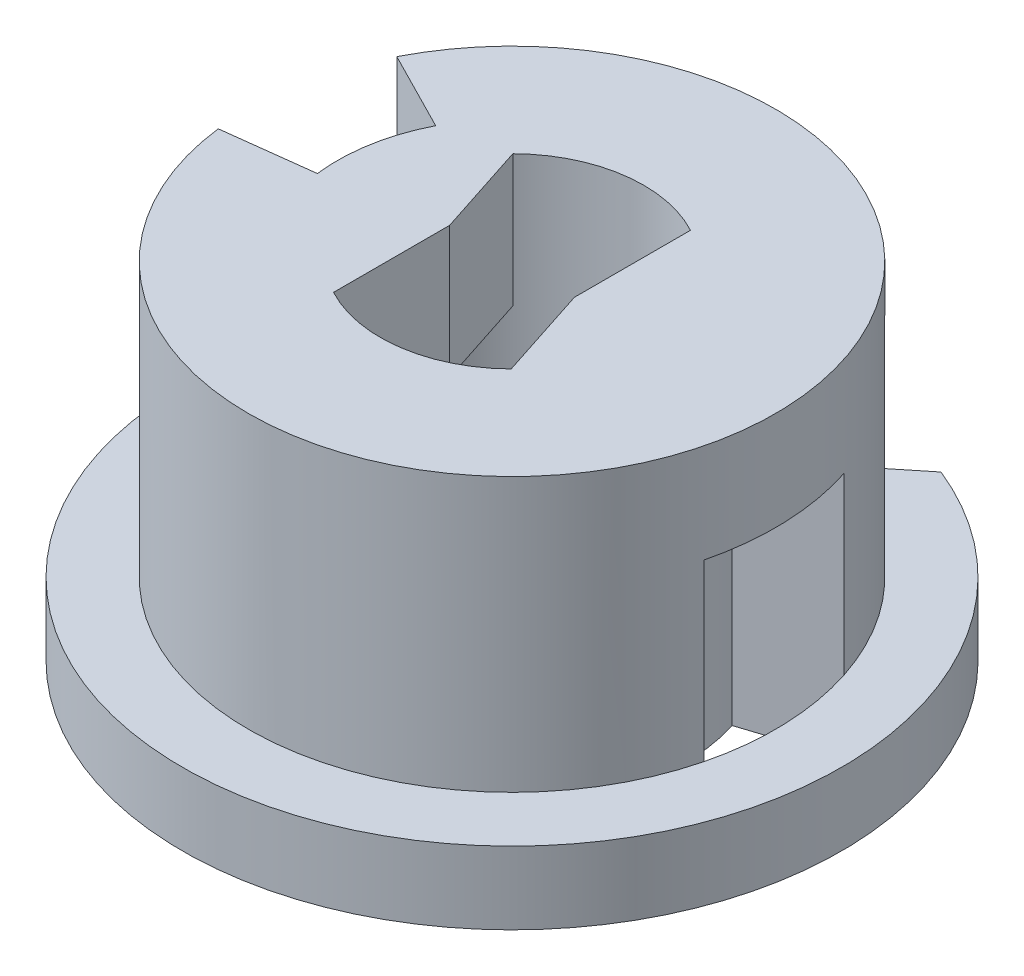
ISO-10303-21;
HEADER;
FILE_DESCRIPTION(('STEP AP214'),'2;1');
FILE_NAME('part.step','',(''),(''),'','','');
FILE_SCHEMA(('AUTOMOTIVE_DESIGN { 1 0 10303 214 1 1 1 1 }'));
ENDSEC;
DATA;
#1=APPLICATION_CONTEXT('core data for automotive mechanical design processes');
#2=APPLICATION_PROTOCOL_DEFINITION('international standard','automotive_design',2000,#1);
#3=PRODUCT_CONTEXT('',#1,'mechanical');
#4=PRODUCT('Part','Part','',(#3));
#5=PRODUCT_RELATED_PRODUCT_CATEGORY('part','',(#4));
#6=PRODUCT_DEFINITION_FORMATION('','',#4);
#7=PRODUCT_DEFINITION_CONTEXT('part definition',#1,'design');
#8=PRODUCT_DEFINITION('design','',#6,#7);
#9=PRODUCT_DEFINITION_SHAPE('','',#8);
#10=(LENGTH_UNIT() NAMED_UNIT(*) SI_UNIT(.MILLI.,.METRE.));
#11=(NAMED_UNIT(*) PLANE_ANGLE_UNIT() SI_UNIT($,.RADIAN.));
#12=(NAMED_UNIT(*) SI_UNIT($,.STERADIAN.) SOLID_ANGLE_UNIT());
#13=UNCERTAINTY_MEASURE_WITH_UNIT(LENGTH_MEASURE(1.E-05),#10,'distance_accuracy_value','');
#14=(GEOMETRIC_REPRESENTATION_CONTEXT(3) GLOBAL_UNCERTAINTY_ASSIGNED_CONTEXT((#13)) GLOBAL_UNIT_ASSIGNED_CONTEXT((#10,
#11,#12)) REPRESENTATION_CONTEXT('',''));
#15=CARTESIAN_POINT('',(0.,0.,0.));
#16=DIRECTION('',(0.,0.,1.));
#17=DIRECTION('',(1.,0.,0.));
#18=AXIS2_PLACEMENT_3D('',#15,#16,#17);
#19=CARTESIAN_POINT('',(0.,6.5,0.));
#20=DIRECTION('',(0.,-1.,0.));
#21=DIRECTION('',(0.,0.,-1.));
#22=AXIS2_PLACEMENT_3D('',#19,#20,#21);
#23=PLANE('',#22);
#24=DIRECTION('',(0.,0.,-1.));
#25=VECTOR('',#24,1.);
#26=CARTESIAN_POINT('',(-1.89263200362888,6.5,0.));
#27=LINE('',#26,#25);
#28=CARTESIAN_POINT('',(-1.89263200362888,6.5,3.52391034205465));
#29=VERTEX_POINT('',#28);
#30=CARTESIAN_POINT('',(-1.89263200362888,6.5,0.));
#31=VERTEX_POINT('',#30);
#32=EDGE_CURVE('E11',#29,#31,#27,.T.);
#33=ORIENTED_EDGE('',*,*,#32,.F.);
#34=CARTESIAN_POINT('',(0.,6.5,0.));
#35=DIRECTION('',(0.,-1.,0.));
#36=DIRECTION('',(0.,0.,-1.));
#37=AXIS2_PLACEMENT_3D('',#34,#35,#36);
#38=CIRCLE('',#37,4.);
#39=CARTESIAN_POINT('',(-2.81574572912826,6.5,-2.84105191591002));
#40=VERTEX_POINT('',#39);
#41=EDGE_CURVE('E611',#29,#40,#38,.T.);
#42=ORIENTED_EDGE('',*,*,#41,.T.);
#43=DIRECTION('',(-0.309016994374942,0.,-0.951056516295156));
#44=VECTOR('',#43,1.);
#45=CARTESIAN_POINT('',(-1.71190172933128,6.5,0.556230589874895));
#46=LINE('',#45,#44);
#47=EDGE_CURVE('E374',#31,#40,#46,.T.);
#48=ORIENTED_EDGE('',*,*,#47,.F.);
#49=EDGE_LOOP('',(#33,#42,#48));
#50=FACE_BOUND('',#49,.T.);
#51=ADVANCED_FACE('F366',(#50),#23,.T.);
#52=CARTESIAN_POINT('',(0.,2.2,0.));
#53=DIRECTION('',(0.,1.,0.));
#54=DIRECTION('',(0.,0.,1.));
#55=AXIS2_PLACEMENT_3D('',#52,#53,#54);
#56=PLANE('',#55);
#57=CARTESIAN_POINT('',(0.,2.2,0.));
#58=DIRECTION('',(0.,1.,0.));
#59=DIRECTION('',(0.,0.,1.));
#60=AXIS2_PLACEMENT_3D('',#57,#58,#59);
#61=CIRCLE('',#60,10.);
#62=CARTESIAN_POINT('',(-7.07106781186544,2.2,-7.07106781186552));
#63=VERTEX_POINT('',#62);
#64=CARTESIAN_POINT('',(3.74606593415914,2.2,-9.27183854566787));
#65=VERTEX_POINT('',#64);
#66=EDGE_CURVE('E658',#63,#65,#61,.T.);
#67=ORIENTED_EDGE('',*,*,#66,.T.);
#68=DIRECTION('',(-0.777145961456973,0.,0.629320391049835));
#69=VECTOR('',#68,1.);
#70=CARTESIAN_POINT('',(-3.05100579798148,2.2,-3.7676783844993));
#71=LINE('',#70,#69);
#72=CARTESIAN_POINT('',(1.89447433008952,2.2,-7.77244922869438));
#73=VERTEX_POINT('',#72);
#74=EDGE_CURVE('E645',#65,#73,#71,.T.);
#75=ORIENTED_EDGE('',*,*,#74,.T.);
#76=CARTESIAN_POINT('',(0.,2.2,0.));
#77=DIRECTION('',(0.,1.,0.));
#78=DIRECTION('',(0.,0.,1.));
#79=AXIS2_PLACEMENT_3D('',#76,#77,#78);
#80=CIRCLE('',#79,8.);
#81=CARTESIAN_POINT('',(7.60845213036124,2.2,-2.47213595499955));
#82=VERTEX_POINT('',#81);
#83=EDGE_CURVE('E648',#82,#73,#80,.T.);
#84=ORIENTED_EDGE('',*,*,#83,.F.);
#85=CARTESIAN_POINT('',(7.76236581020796,2.2,1.93537516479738));
#86=VERTEX_POINT('',#85);
#87=EDGE_CURVE('E516',#86,#82,#80,.T.);
#88=ORIENTED_EDGE('',*,*,#87,.F.);
#89=CARTESIAN_POINT('',(-5.65685424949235,2.2,-5.65685424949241));
#90=VERTEX_POINT('',#89);
#91=EDGE_CURVE('E649',#90,#86,#80,.T.);
#92=ORIENTED_EDGE('',*,*,#91,.F.);
#93=DIRECTION('',(-0.707106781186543,0.,-0.707106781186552));
#94=VECTOR('',#93,1.);
#95=CARTESIAN_POINT('',(0.,2.2,0.));
#96=LINE('',#95,#94);
#97=EDGE_CURVE('E636',#90,#63,#96,.T.);
#98=ORIENTED_EDGE('',*,*,#97,.T.);
#99=EDGE_LOOP('',(#67,#75,#84,#88,#92,#98));
#100=FACE_BOUND('',#99,.T.);
#101=ADVANCED_FACE('F716',(#100),#56,.T.);
#102=CARTESIAN_POINT('',(0.,2.2,0.));
#103=DIRECTION('',(0.,-1.,0.));
#104=DIRECTION('',(0.,0.,-1.));
#105=AXIS2_PLACEMENT_3D('',#102,#103,#104);
#106=CYLINDRICAL_SURFACE('',#105,10.);
#107=DIRECTION('',(0.,-1.,0.));
#108=VECTOR('',#107,1.);
#109=CARTESIAN_POINT('',(3.74606593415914,3.2,-9.27183854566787));
#110=LINE('',#109,#108);
#111=CARTESIAN_POINT('',(3.74606593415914,0.,-9.27183854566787));
#112=VERTEX_POINT('',#111);
#113=EDGE_CURVE('E637',#65,#112,#110,.T.);
#114=ORIENTED_EDGE('',*,*,#113,.F.);
#115=ORIENTED_EDGE('',*,*,#66,.F.);
#116=DIRECTION('',(0.,-1.,0.));
#117=VECTOR('',#116,1.);
#118=CARTESIAN_POINT('',(-7.07106781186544,3.2,-7.07106781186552));
#119=LINE('',#118,#117);
#120=CARTESIAN_POINT('',(-7.07106781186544,0.,-7.07106781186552));
#121=VERTEX_POINT('',#120);
#122=EDGE_CURVE('E639',#63,#121,#119,.T.);
#123=ORIENTED_EDGE('',*,*,#122,.T.);
#124=CARTESIAN_POINT('',(0.,0.,0.));
#125=DIRECTION('',(0.,1.,0.));
#126=DIRECTION('',(0.,0.,1.));
#127=AXIS2_PLACEMENT_3D('',#124,#125,#126);
#128=CIRCLE('',#127,10.);
#129=EDGE_CURVE('E655',#121,#112,#128,.T.);
#130=ORIENTED_EDGE('',*,*,#129,.T.);
#131=EDGE_LOOP('',(#114,#115,#123,#130));
#132=FACE_BOUND('',#131,.T.);
#133=ADVANCED_FACE('F368',(#132),#106,.T.);
#134=CARTESIAN_POINT('',(0.,0.,0.));
#135=DIRECTION('',(0.,1.,0.));
#136=DIRECTION('',(0.,0.,1.));
#137=AXIS2_PLACEMENT_3D('',#134,#135,#136);
#138=PLANE('',#137);
#139=DIRECTION('',(0.951056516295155,0.,-0.309016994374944));
#140=VECTOR('',#139,1.);
#141=CARTESIAN_POINT('',(5.04059953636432,0.,-1.6377900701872));
#142=LINE('',#141,#140);
#143=CARTESIAN_POINT('',(5.04059953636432,0.,-1.6377900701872));
#144=VERTEX_POINT('',#143);
#145=CARTESIAN_POINT('',(7.60845213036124,0.,-2.47213595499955));
#146=VERTEX_POINT('',#145);
#147=EDGE_CURVE('E523',#144,#146,#142,.T.);
#148=ORIENTED_EDGE('',*,*,#147,.F.);
#149=CARTESIAN_POINT('',(0.,0.,0.));
#150=DIRECTION('',(0.,1.,0.));
#151=DIRECTION('',(0.,0.,-1.));
#152=AXIS2_PLACEMENT_3D('',#149,#150,#151);
#153=CIRCLE('',#152,5.3);
#154=CARTESIAN_POINT('',(5.14256734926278,0.,1.28218604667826));
#155=VERTEX_POINT('',#154);
#156=EDGE_CURVE('E381',#155,#144,#153,.T.);
#157=ORIENTED_EDGE('',*,*,#156,.F.);
#158=DIRECTION('',(-0.970295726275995,0.,-0.241921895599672));
#159=VECTOR('',#158,1.);
#160=CARTESIAN_POINT('',(5.14256734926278,0.,1.28218604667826));
#161=LINE('',#160,#159);
#162=CARTESIAN_POINT('',(7.76236581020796,0.,1.93537516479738));
#163=VERTEX_POINT('',#162);
#164=EDGE_CURVE('E530',#163,#155,#161,.T.);
#165=ORIENTED_EDGE('',*,*,#164,.F.);
#166=CARTESIAN_POINT('',(0.,0.,0.));
#167=DIRECTION('',(0.,-1.,0.));
#168=DIRECTION('',(0.,0.,-1.));
#169=AXIS2_PLACEMENT_3D('',#166,#167,#168);
#170=CIRCLE('',#169,8.);
#171=EDGE_CURVE('E513',#146,#163,#170,.T.);
#172=ORIENTED_EDGE('',*,*,#171,.F.);
#173=EDGE_LOOP('',(#148,#157,#165,#172));
#174=FACE_BOUND('',#173,.T.);
#175=CARTESIAN_POINT('',(0.,0.,0.));
#176=DIRECTION('',(0.,-1.,0.));
#177=DIRECTION('',(0.,0.,-1.));
#178=AXIS2_PLACEMENT_3D('',#175,#176,#177);
#179=CIRCLE('',#178,4.);
#180=CARTESIAN_POINT('',(0.,0.,-4.));
#181=VERTEX_POINT('',#180);
#182=EDGE_CURVE('E598',#181,#181,#179,.T.);
#183=ORIENTED_EDGE('',*,*,#182,.F.);
#184=EDGE_LOOP('',(#183));
#185=FACE_BOUND('',#184,.T.);
#186=DIRECTION('',(0.777145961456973,0.,-0.629320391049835));
#187=VECTOR('',#186,1.);
#188=CARTESIAN_POINT('',(7.7777832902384,0.,-12.536658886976));
#189=LINE('',#188,#187);
#190=CARTESIAN_POINT('',(0.3137726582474,0.,-6.49242225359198));
#191=VERTEX_POINT('',#190);
#192=EDGE_CURVE('E621',#191,#112,#189,.T.);
#193=ORIENTED_EDGE('',*,*,#192,.T.);
#194=ORIENTED_EDGE('',*,*,#129,.F.);
#195=DIRECTION('',(0.707106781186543,0.,0.707106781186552));
#196=VECTOR('',#195,1.);
#197=CARTESIAN_POINT('',(-11.0707106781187,0.,-11.0707106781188));
#198=LINE('',#197,#196);
#199=CARTESIAN_POINT('',(-4.59619407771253,0.,-4.59619407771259));
#200=VERTEX_POINT('',#199);
#201=EDGE_CURVE('E618',#121,#200,#198,.T.);
#202=ORIENTED_EDGE('',*,*,#201,.T.);
#203=CARTESIAN_POINT('',(0.,0.,0.));
#204=DIRECTION('',(0.,-1.,0.));
#205=DIRECTION('',(0.,0.,-1.));
#206=AXIS2_PLACEMENT_3D('',#203,#204,#205);
#207=CIRCLE('',#206,6.5);
#208=EDGE_CURVE('E615',#200,#191,#207,.T.);
#209=ORIENTED_EDGE('',*,*,#208,.T.);
#210=EDGE_LOOP('',(#193,#194,#202,#209));
#211=FACE_BOUND('',#210,.T.);
#212=ADVANCED_FACE('F527',(#174,#185,#211),#138,.F.);
#213=CARTESIAN_POINT('',(0.,10.5,0.));
#214=DIRECTION('',(0.,-1.,0.));
#215=DIRECTION('',(0.,0.,-1.));
#216=AXIS2_PLACEMENT_3D('',#213,#214,#215);
#217=CYLINDRICAL_SURFACE('',#216,8.);
#218=ORIENTED_EDGE('',*,*,#91,.T.);
#219=DIRECTION('',(0.,-1.,0.));
#220=VECTOR('',#219,1.);
#221=CARTESIAN_POINT('',(7.76236581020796,7.5,1.93537516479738));
#222=LINE('',#221,#220);
#223=CARTESIAN_POINT('',(7.76236581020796,7.5,1.93537516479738));
#224=VERTEX_POINT('',#223);
#225=EDGE_CURVE('E546',#224,#86,#222,.T.);
#226=ORIENTED_EDGE('',*,*,#225,.F.);
#227=CARTESIAN_POINT('',(0.,7.5,0.));
#228=DIRECTION('',(0.,-1.,0.));
#229=DIRECTION('',(0.,0.,-1.));
#230=AXIS2_PLACEMENT_3D('',#227,#228,#229);
#231=CIRCLE('',#230,8.);
#232=CARTESIAN_POINT('',(7.60845213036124,7.5,-2.47213595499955));
#233=VERTEX_POINT('',#232);
#234=EDGE_CURVE('E538',#233,#224,#231,.T.);
#235=ORIENTED_EDGE('',*,*,#234,.F.);
#236=DIRECTION('',(0.,-1.,0.));
#237=VECTOR('',#236,1.);
#238=CARTESIAN_POINT('',(7.60845213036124,7.5,-2.47213595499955));
#239=LINE('',#238,#237);
#240=EDGE_CURVE('E519',#233,#82,#239,.T.);
#241=ORIENTED_EDGE('',*,*,#240,.T.);
#242=ORIENTED_EDGE('',*,*,#83,.T.);
#243=DIRECTION('',(0.,-1.,0.));
#244=VECTOR('',#243,1.);
#245=CARTESIAN_POINT('',(1.89447433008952,10.5,-7.77244922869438));
#246=LINE('',#245,#244);
#247=CARTESIAN_POINT('',(1.89447433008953,3.2,-7.77244922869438));
#248=VERTEX_POINT('',#247);
#249=EDGE_CURVE('E666',#248,#73,#246,.T.);
#250=ORIENTED_EDGE('',*,*,#249,.F.);
#251=CARTESIAN_POINT('',(0.,3.2,0.));
#252=DIRECTION('',(0.,-1.,0.));
#253=DIRECTION('',(0.,0.,-1.));
#254=AXIS2_PLACEMENT_3D('',#251,#252,#253);
#255=CIRCLE('',#254,8.);
#256=CARTESIAN_POINT('',(-5.65685424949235,3.2,-5.65685424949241));
#257=VERTEX_POINT('',#256);
#258=EDGE_CURVE('E661',#257,#248,#255,.T.);
#259=ORIENTED_EDGE('',*,*,#258,.F.);
#260=DIRECTION('',(0.,-1.,0.));
#261=VECTOR('',#260,1.);
#262=CARTESIAN_POINT('',(-5.65685424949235,10.5,-5.65685424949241));
#263=LINE('',#262,#261);
#264=EDGE_CURVE('E663',#90,#257,#263,.F.);
#265=ORIENTED_EDGE('',*,*,#264,.F.);
#266=EDGE_LOOP('',(#218,#226,#235,#241,#242,#250,#259,#265));
#267=FACE_BOUND('',#266,.T.);
#268=CARTESIAN_POINT('',(0.,10.5,0.));
#269=DIRECTION('',(0.,1.,0.));
#270=DIRECTION('',(0.,0.,1.));
#271=AXIS2_PLACEMENT_3D('',#268,#269,#270);
#272=CIRCLE('',#271,8.);
#273=CARTESIAN_POINT('',(-7.94036921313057,10.5,0.974954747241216));
#274=VERTEX_POINT('',#273);
#275=CARTESIAN_POINT('',(-7.12805219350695,10.5,-3.63192399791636));
#276=VERTEX_POINT('',#275);
#277=EDGE_CURVE('E652',#274,#276,#272,.T.);
#278=ORIENTED_EDGE('',*,*,#277,.F.);
#279=DIRECTION('',(0.,1.,0.));
#280=VECTOR('',#279,1.);
#281=CARTESIAN_POINT('',(-7.94036921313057,5.5,0.974954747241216));
#282=LINE('',#281,#280);
#283=CARTESIAN_POINT('',(-7.94036921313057,5.5,0.974954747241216));
#284=VERTEX_POINT('',#283);
#285=EDGE_CURVE('E572',#284,#274,#282,.T.);
#286=ORIENTED_EDGE('',*,*,#285,.F.);
#287=CARTESIAN_POINT('',(0.,5.5,0.));
#288=DIRECTION('',(0.,1.,0.));
#289=DIRECTION('',(0.,0.,1.));
#290=AXIS2_PLACEMENT_3D('',#287,#288,#289);
#291=CIRCLE('',#290,8.);
#292=CARTESIAN_POINT('',(-7.12805219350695,5.5,-3.63192399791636));
#293=VERTEX_POINT('',#292);
#294=EDGE_CURVE('E563',#293,#284,#291,.T.);
#295=ORIENTED_EDGE('',*,*,#294,.F.);
#296=DIRECTION('',(0.,1.,0.));
#297=VECTOR('',#296,1.);
#298=CARTESIAN_POINT('',(-7.12805219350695,5.5,-3.63192399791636));
#299=LINE('',#298,#297);
#300=EDGE_CURVE('E574',#293,#276,#299,.T.);
#301=ORIENTED_EDGE('',*,*,#300,.T.);
#302=EDGE_LOOP('',(#278,#286,#295,#301));
#303=FACE_BOUND('',#302,.T.);
#304=ADVANCED_FACE('F730',(#267,#303),#217,.T.);
#305=CARTESIAN_POINT('',(0.,10.5,0.));
#306=DIRECTION('',(0.,1.,0.));
#307=DIRECTION('',(0.,0.,1.));
#308=AXIS2_PLACEMENT_3D('',#305,#306,#307);
#309=PLANE('',#308);
#310=DIRECTION('',(0.992546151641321,0.,-0.121869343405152));
#311=VECTOR('',#310,1.);
#312=CARTESIAN_POINT('',(-5.260494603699,10.5,0.645907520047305));
#313=LINE('',#312,#311);
#314=CARTESIAN_POINT('',(-5.260494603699,10.5,0.645907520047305));
#315=VERTEX_POINT('',#314);
#316=EDGE_CURVE('E554',#274,#315,#313,.T.);
#317=ORIENTED_EDGE('',*,*,#316,.F.);
#318=ORIENTED_EDGE('',*,*,#277,.T.);
#319=DIRECTION('',(-0.891006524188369,0.,-0.453990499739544));
#320=VECTOR('',#319,1.);
#321=CARTESIAN_POINT('',(-4.72233457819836,10.5,-2.40614964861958));
#322=LINE('',#321,#320);
#323=CARTESIAN_POINT('',(-4.72233457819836,10.5,-2.40614964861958));
#324=VERTEX_POINT('',#323);
#325=EDGE_CURVE('E552',#324,#276,#322,.T.);
#326=ORIENTED_EDGE('',*,*,#325,.F.);
#327=CARTESIAN_POINT('',(0.,10.5,0.));
#328=DIRECTION('',(0.,-1.,0.));
#329=DIRECTION('',(0.,0.,1.));
#330=AXIS2_PLACEMENT_3D('',#327,#328,#329);
#331=CIRCLE('',#330,5.3);
#332=EDGE_CURVE('E545',#315,#324,#331,.T.);
#333=ORIENTED_EDGE('',*,*,#332,.F.);
#334=EDGE_LOOP('',(#317,#318,#326,#333));
#335=FACE_BOUND('',#334,.T.);
#336=CARTESIAN_POINT('',(0.,10.5,0.));
#337=DIRECTION('',(0.,1.,0.));
#338=DIRECTION('',(0.,0.,1.));
#339=AXIS2_PLACEMENT_3D('',#336,#337,#338);
#340=CIRCLE('',#339,4.);
#341=CARTESIAN_POINT('',(-1.89263200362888,10.5,3.52391034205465));
#342=VERTEX_POINT('',#341);
#343=CARTESIAN_POINT('',(2.81574572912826,10.5,2.84105191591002));
#344=VERTEX_POINT('',#343);
#345=EDGE_CURVE('E571',#342,#344,#340,.T.);
#346=ORIENTED_EDGE('',*,*,#345,.F.);
#347=DIRECTION('',(0.,0.,1.));
#348=VECTOR('',#347,1.);
#349=CARTESIAN_POINT('',(-1.89263200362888,10.5,0.));
#350=LINE('',#349,#348);
#351=CARTESIAN_POINT('',(-1.89263200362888,10.5,0.));
#352=VERTEX_POINT('',#351);
#353=EDGE_CURVE('E592',#352,#342,#350,.T.);
#354=ORIENTED_EDGE('',*,*,#353,.F.);
#355=DIRECTION('',(0.309016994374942,0.,0.951056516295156));
#356=VECTOR('',#355,1.);
#357=CARTESIAN_POINT('',(-2.81574572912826,10.5,-2.84105191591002));
#358=LINE('',#357,#356);
#359=CARTESIAN_POINT('',(-2.81574572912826,10.5,-2.84105191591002));
#360=VERTEX_POINT('',#359);
#361=EDGE_CURVE('E589',#360,#352,#358,.T.);
#362=ORIENTED_EDGE('',*,*,#361,.F.);
#363=CARTESIAN_POINT('',(0.,10.5,0.));
#364=DIRECTION('',(0.,1.,0.));
#365=DIRECTION('',(0.,0.,1.));
#366=AXIS2_PLACEMENT_3D('',#363,#364,#365);
#367=CIRCLE('',#366,4.);
#368=CARTESIAN_POINT('',(1.89263200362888,10.5,-3.52391034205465));
#369=VERTEX_POINT('',#368);
#370=EDGE_CURVE('E586',#369,#360,#367,.T.);
#371=ORIENTED_EDGE('',*,*,#370,.F.);
#372=DIRECTION('',(0.,0.,-1.));
#373=VECTOR('',#372,1.);
#374=CARTESIAN_POINT('',(1.89263200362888,10.5,0.));
#375=LINE('',#374,#373);
#376=CARTESIAN_POINT('',(1.89263200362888,10.5,0.));
#377=VERTEX_POINT('',#376);
#378=EDGE_CURVE('E583',#377,#369,#375,.T.);
#379=ORIENTED_EDGE('',*,*,#378,.F.);
#380=DIRECTION('',(-0.309016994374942,0.,-0.951056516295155));
#381=VECTOR('',#380,1.);
#382=CARTESIAN_POINT('',(2.81574572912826,10.5,2.84105191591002));
#383=LINE('',#382,#381);
#384=EDGE_CURVE('E580',#344,#377,#383,.T.);
#385=ORIENTED_EDGE('',*,*,#384,.F.);
#386=EDGE_LOOP('',(#346,#354,#362,#371,#379,#385));
#387=FACE_BOUND('',#386,.T.);
#388=ADVANCED_FACE('F698',(#335,#387),#309,.T.);
#389=CARTESIAN_POINT('',(0.,3.2,-22.1414213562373));
#390=DIRECTION('',(0.,-1.,0.));
#391=DIRECTION('',(0.,0.,-1.));
#392=AXIS2_PLACEMENT_3D('',#389,#390,#391);
#393=PLANE('',#392);
#394=ORIENTED_EDGE('',*,*,#258,.T.);
#395=DIRECTION('',(0.777145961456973,0.,-0.629320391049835));
#396=VECTOR('',#395,1.);
#397=CARTESIAN_POINT('',(7.7777832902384,3.2,-12.536658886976));
#398=LINE('',#397,#396);
#399=CARTESIAN_POINT('',(0.3137726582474,3.2,-6.49242225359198));
#400=VERTEX_POINT('',#399);
#401=EDGE_CURVE('E629',#400,#248,#398,.T.);
#402=ORIENTED_EDGE('',*,*,#401,.F.);
#403=CARTESIAN_POINT('',(0.,3.2,0.));
#404=DIRECTION('',(0.,-1.,0.));
#405=DIRECTION('',(0.,0.,-1.));
#406=AXIS2_PLACEMENT_3D('',#403,#404,#405);
#407=CIRCLE('',#406,6.5);
#408=CARTESIAN_POINT('',(-4.59619407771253,3.2,-4.59619407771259));
#409=VERTEX_POINT('',#408);
#410=EDGE_CURVE('E624',#409,#400,#407,.T.);
#411=ORIENTED_EDGE('',*,*,#410,.F.);
#412=DIRECTION('',(0.707106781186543,0.,0.707106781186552));
#413=VECTOR('',#412,1.);
#414=CARTESIAN_POINT('',(-11.0707106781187,3.2,-11.0707106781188));
#415=LINE('',#414,#413);
#416=EDGE_CURVE('E627',#257,#409,#415,.T.);
#417=ORIENTED_EDGE('',*,*,#416,.F.);
#418=EDGE_LOOP('',(#394,#402,#411,#417));
#419=FACE_BOUND('',#418,.T.);
#420=ADVANCED_FACE('F736',(#419),#393,.T.);
#421=CARTESIAN_POINT('',(0.,3.2,0.));
#422=DIRECTION('',(0.,-1.,0.));
#423=DIRECTION('',(0.,0.,-1.));
#424=AXIS2_PLACEMENT_3D('',#421,#422,#423);
#425=CYLINDRICAL_SURFACE('',#424,6.5);
#426=ORIENTED_EDGE('',*,*,#208,.F.);
#427=DIRECTION('',(0.,-1.,0.));
#428=VECTOR('',#427,1.);
#429=CARTESIAN_POINT('',(-4.59619407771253,3.2,-4.59619407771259));
#430=LINE('',#429,#428);
#431=EDGE_CURVE('E632',#409,#200,#430,.T.);
#432=ORIENTED_EDGE('',*,*,#431,.F.);
#433=ORIENTED_EDGE('',*,*,#410,.T.);
#434=DIRECTION('',(0.,-1.,0.));
#435=VECTOR('',#434,1.);
#436=CARTESIAN_POINT('',(0.3137726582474,3.2,-6.49242225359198));
#437=LINE('',#436,#435);
#438=EDGE_CURVE('E633',#400,#191,#437,.T.);
#439=ORIENTED_EDGE('',*,*,#438,.T.);
#440=EDGE_LOOP('',(#426,#432,#433,#439));
#441=FACE_BOUND('',#440,.T.);
#442=ADVANCED_FACE('F738',(#441),#425,.T.);
#443=CARTESIAN_POINT('',(7.7777832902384,3.2,-12.536658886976));
#444=DIRECTION('',(-0.629320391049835,0.,-0.777145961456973));
#445=DIRECTION('',(-0.777145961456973,0.,0.629320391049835));
#446=AXIS2_PLACEMENT_3D('',#443,#444,#445);
#447=PLANE('',#446);
#448=ORIENTED_EDGE('',*,*,#113,.T.);
#449=ORIENTED_EDGE('',*,*,#192,.F.);
#450=ORIENTED_EDGE('',*,*,#438,.F.);
#451=ORIENTED_EDGE('',*,*,#401,.T.);
#452=ORIENTED_EDGE('',*,*,#249,.T.);
#453=ORIENTED_EDGE('',*,*,#74,.F.);
#454=EDGE_LOOP('',(#448,#449,#450,#451,#452,#453));
#455=FACE_BOUND('',#454,.T.);
#456=ADVANCED_FACE('F741',(#455),#447,.T.);
#457=CARTESIAN_POINT('',(-11.0707106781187,3.2,-11.0707106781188));
#458=DIRECTION('',(0.707106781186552,0.,-0.707106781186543));
#459=DIRECTION('',(-0.707106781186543,0.,-0.707106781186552));
#460=AXIS2_PLACEMENT_3D('',#457,#458,#459);
#461=PLANE('',#460);
#462=ORIENTED_EDGE('',*,*,#264,.T.);
#463=ORIENTED_EDGE('',*,*,#416,.T.);
#464=ORIENTED_EDGE('',*,*,#431,.T.);
#465=ORIENTED_EDGE('',*,*,#201,.F.);
#466=ORIENTED_EDGE('',*,*,#122,.F.);
#467=ORIENTED_EDGE('',*,*,#97,.F.);
#468=EDGE_LOOP('',(#462,#463,#464,#465,#466,#467));
#469=FACE_BOUND('',#468,.T.);
#470=ADVANCED_FACE('F711',(#469),#461,.T.);
#471=CARTESIAN_POINT('',(0.,6.5,0.));
#472=DIRECTION('',(0.,-1.,0.));
#473=DIRECTION('',(0.,0.,-1.));
#474=AXIS2_PLACEMENT_3D('',#471,#472,#473);
#475=CYLINDRICAL_SURFACE('',#474,4.);
#476=ORIENTED_EDGE('',*,*,#182,.T.);
#477=EDGE_LOOP('',(#476));
#478=FACE_BOUND('',#477,.T.);
#479=CARTESIAN_POINT('',(1.89263200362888,6.5,-3.52391034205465));
#480=VERTEX_POINT('',#479);
#481=CARTESIAN_POINT('',(2.81574572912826,6.5,2.84105191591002));
#482=VERTEX_POINT('',#481);
#483=EDGE_CURVE('E612',#480,#482,#38,.T.);
#484=ORIENTED_EDGE('',*,*,#483,.F.);
#485=DIRECTION('',(0.,1.,0.));
#486=VECTOR('',#485,1.);
#487=CARTESIAN_POINT('',(1.89263200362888,0.,-3.52391034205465));
#488=LINE('',#487,#486);
#489=EDGE_CURVE('E603',#480,#369,#488,.T.);
#490=ORIENTED_EDGE('',*,*,#489,.T.);
#491=ORIENTED_EDGE('',*,*,#370,.T.);
#492=DIRECTION('',(0.,1.,0.));
#493=VECTOR('',#492,1.);
#494=CARTESIAN_POINT('',(-2.81574572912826,0.,-2.84105191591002));
#495=LINE('',#494,#493);
#496=EDGE_CURVE('E601',#40,#360,#495,.T.);
#497=ORIENTED_EDGE('',*,*,#496,.F.);
#498=ORIENTED_EDGE('',*,*,#41,.F.);
#499=DIRECTION('',(0.,1.,0.));
#500=VECTOR('',#499,1.);
#501=CARTESIAN_POINT('',(-1.89263200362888,0.,3.52391034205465));
#502=LINE('',#501,#500);
#503=EDGE_CURVE('E596',#29,#342,#502,.T.);
#504=ORIENTED_EDGE('',*,*,#503,.T.);
#505=ORIENTED_EDGE('',*,*,#345,.T.);
#506=DIRECTION('',(0.,1.,0.));
#507=VECTOR('',#506,1.);
#508=CARTESIAN_POINT('',(2.81574572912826,0.,2.84105191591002));
#509=LINE('',#508,#507);
#510=EDGE_CURVE('E595',#482,#344,#509,.T.);
#511=ORIENTED_EDGE('',*,*,#510,.F.);
#512=EDGE_LOOP('',(#484,#490,#491,#497,#498,#504,#505,#511));
#513=FACE_BOUND('',#512,.T.);
#514=ADVANCED_FACE('F684',(#478,#513),#475,.F.);
#515=DIRECTION('',(0.,0.,1.));
#516=VECTOR('',#515,1.);
#517=CARTESIAN_POINT('',(1.89263200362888,6.5,0.));
#518=LINE('',#517,#516);
#519=CARTESIAN_POINT('',(1.89263200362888,6.5,0.));
#520=VERTEX_POINT('',#519);
#521=EDGE_CURVE('E671',#480,#520,#518,.T.);
#522=ORIENTED_EDGE('',*,*,#521,.F.);
#523=ORIENTED_EDGE('',*,*,#483,.T.);
#524=DIRECTION('',(0.309016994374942,0.,0.951056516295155));
#525=VECTOR('',#524,1.);
#526=CARTESIAN_POINT('',(1.71190172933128,6.5,-0.556230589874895));
#527=LINE('',#526,#525);
#528=EDGE_CURVE('E669',#520,#482,#527,.T.);
#529=ORIENTED_EDGE('',*,*,#528,.F.);
#530=EDGE_LOOP('',(#522,#523,#529));
#531=FACE_BOUND('',#530,.T.);
#532=ADVANCED_FACE('F703',(#531),#23,.T.);
#533=CARTESIAN_POINT('',(-1.89263200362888,0.,0.));
#534=DIRECTION('',(-1.,0.,0.));
#535=DIRECTION('',(0.,0.,1.));
#536=AXIS2_PLACEMENT_3D('',#533,#534,#535);
#537=PLANE('',#536);
#538=ORIENTED_EDGE('',*,*,#32,.T.);
#539=DIRECTION('',(0.,1.,0.));
#540=VECTOR('',#539,1.);
#541=CARTESIAN_POINT('',(-1.89263200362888,0.,0.));
#542=LINE('',#541,#540);
#543=EDGE_CURVE('E599',#31,#352,#542,.T.);
#544=ORIENTED_EDGE('',*,*,#543,.T.);
#545=ORIENTED_EDGE('',*,*,#353,.T.);
#546=ORIENTED_EDGE('',*,*,#503,.F.);
#547=EDGE_LOOP('',(#538,#544,#545,#546));
#548=FACE_BOUND('',#547,.T.);
#549=ADVANCED_FACE('F688',(#548),#537,.F.);
#550=CARTESIAN_POINT('',(-2.81574572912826,0.,-2.84105191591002));
#551=DIRECTION('',(-0.951056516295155,0.,0.309016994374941));
#552=DIRECTION('',(0.309016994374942,0.,0.951056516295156));
#553=AXIS2_PLACEMENT_3D('',#550,#551,#552);
#554=PLANE('',#553);
#555=ORIENTED_EDGE('',*,*,#47,.T.);
#556=ORIENTED_EDGE('',*,*,#496,.T.);
#557=ORIENTED_EDGE('',*,*,#361,.T.);
#558=ORIENTED_EDGE('',*,*,#543,.F.);
#559=EDGE_LOOP('',(#555,#556,#557,#558));
#560=FACE_BOUND('',#559,.T.);
#561=ADVANCED_FACE('F677',(#560),#554,.F.);
#562=CARTESIAN_POINT('',(1.89263200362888,0.,0.));
#563=DIRECTION('',(1.,0.,0.));
#564=DIRECTION('',(0.,0.,-1.));
#565=AXIS2_PLACEMENT_3D('',#562,#563,#564);
#566=PLANE('',#565);
#567=ORIENTED_EDGE('',*,*,#521,.T.);
#568=DIRECTION('',(0.,1.,0.));
#569=VECTOR('',#568,1.);
#570=CARTESIAN_POINT('',(1.89263200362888,0.,0.));
#571=LINE('',#570,#569);
#572=EDGE_CURVE('E605',#520,#377,#571,.T.);
#573=ORIENTED_EDGE('',*,*,#572,.T.);
#574=ORIENTED_EDGE('',*,*,#378,.T.);
#575=ORIENTED_EDGE('',*,*,#489,.F.);
#576=EDGE_LOOP('',(#567,#573,#574,#575));
#577=FACE_BOUND('',#576,.T.);
#578=ADVANCED_FACE('F700',(#577),#566,.F.);
#579=CARTESIAN_POINT('',(2.81574572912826,0.,2.84105191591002));
#580=DIRECTION('',(0.951056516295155,0.,-0.309016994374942));
#581=DIRECTION('',(-0.309016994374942,0.,-0.951056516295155));
#582=AXIS2_PLACEMENT_3D('',#579,#580,#581);
#583=PLANE('',#582);
#584=ORIENTED_EDGE('',*,*,#528,.T.);
#585=ORIENTED_EDGE('',*,*,#510,.T.);
#586=ORIENTED_EDGE('',*,*,#384,.T.);
#587=ORIENTED_EDGE('',*,*,#572,.F.);
#588=EDGE_LOOP('',(#584,#585,#586,#587));
#589=FACE_BOUND('',#588,.T.);
#590=ADVANCED_FACE('F695',(#589),#583,.F.);
#591=CARTESIAN_POINT('',(0.,5.5,0.));
#592=DIRECTION('',(0.,1.,0.));
#593=DIRECTION('',(0.,0.,1.));
#594=AXIS2_PLACEMENT_3D('',#591,#592,#593);
#595=CYLINDRICAL_SURFACE('',#594,5.3);
#596=ORIENTED_EDGE('',*,*,#332,.T.);
#597=DIRECTION('',(0.,1.,0.));
#598=VECTOR('',#597,1.);
#599=CARTESIAN_POINT('',(-4.72233457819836,5.5,-2.40614964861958));
#600=LINE('',#599,#598);
#601=CARTESIAN_POINT('',(-4.72233457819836,5.5,-2.40614964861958));
#602=VERTEX_POINT('',#601);
#603=EDGE_CURVE('E568',#602,#324,#600,.T.);
#604=ORIENTED_EDGE('',*,*,#603,.F.);
#605=CARTESIAN_POINT('',(0.,5.5,0.));
#606=DIRECTION('',(0.,-1.,0.));
#607=DIRECTION('',(0.,0.,1.));
#608=AXIS2_PLACEMENT_3D('',#605,#606,#607);
#609=CIRCLE('',#608,5.3);
#610=CARTESIAN_POINT('',(-5.260494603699,5.5,0.645907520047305));
#611=VERTEX_POINT('',#610);
#612=EDGE_CURVE('E557',#611,#602,#609,.T.);
#613=ORIENTED_EDGE('',*,*,#612,.F.);
#614=DIRECTION('',(0.,1.,0.));
#615=VECTOR('',#614,1.);
#616=CARTESIAN_POINT('',(-5.260494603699,5.5,0.645907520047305));
#617=LINE('',#616,#615);
#618=EDGE_CURVE('E569',#611,#315,#617,.T.);
#619=ORIENTED_EDGE('',*,*,#618,.T.);
#620=EDGE_LOOP('',(#596,#604,#613,#619));
#621=FACE_BOUND('',#620,.T.);
#622=ADVANCED_FACE('F790',(#621),#595,.T.);
#623=CARTESIAN_POINT('',(-5.260494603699,5.5,0.645907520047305));
#624=DIRECTION('',(0.121869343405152,0.,0.992546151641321));
#625=DIRECTION('',(0.992546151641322,0.,-0.121869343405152));
#626=AXIS2_PLACEMENT_3D('',#623,#624,#625);
#627=PLANE('',#626);
#628=ORIENTED_EDGE('',*,*,#316,.T.);
#629=ORIENTED_EDGE('',*,*,#618,.F.);
#630=DIRECTION('',(0.992546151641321,0.,-0.121869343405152));
#631=VECTOR('',#630,1.);
#632=CARTESIAN_POINT('',(-5.260494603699,5.5,0.645907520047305));
#633=LINE('',#632,#631);
#634=EDGE_CURVE('E565',#284,#611,#633,.T.);
#635=ORIENTED_EDGE('',*,*,#634,.F.);
#636=ORIENTED_EDGE('',*,*,#285,.T.);
#637=EDGE_LOOP('',(#628,#629,#635,#636));
#638=FACE_BOUND('',#637,.T.);
#639=ADVANCED_FACE('F787',(#638),#627,.F.);
#640=CARTESIAN_POINT('',(-4.72233457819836,5.5,-2.40614964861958));
#641=DIRECTION('',(0.453990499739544,0.,-0.891006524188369));
#642=DIRECTION('',(-0.891006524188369,0.,-0.453990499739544));
#643=AXIS2_PLACEMENT_3D('',#640,#641,#642);
#644=PLANE('',#643);
#645=ORIENTED_EDGE('',*,*,#325,.T.);
#646=ORIENTED_EDGE('',*,*,#300,.F.);
#647=DIRECTION('',(-0.891006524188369,0.,-0.453990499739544));
#648=VECTOR('',#647,1.);
#649=CARTESIAN_POINT('',(-4.72233457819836,5.5,-2.40614964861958));
#650=LINE('',#649,#648);
#651=EDGE_CURVE('E560',#602,#293,#650,.T.);
#652=ORIENTED_EDGE('',*,*,#651,.F.);
#653=ORIENTED_EDGE('',*,*,#603,.T.);
#654=EDGE_LOOP('',(#645,#646,#652,#653));
#655=FACE_BOUND('',#654,.T.);
#656=ADVANCED_FACE('F781',(#655),#644,.F.);
#657=CARTESIAN_POINT('',(0.,5.5,0.));
#658=DIRECTION('',(0.,1.,0.));
#659=DIRECTION('',(0.,0.,1.));
#660=AXIS2_PLACEMENT_3D('',#657,#658,#659);
#661=PLANE('',#660);
#662=ORIENTED_EDGE('',*,*,#612,.T.);
#663=ORIENTED_EDGE('',*,*,#651,.T.);
#664=ORIENTED_EDGE('',*,*,#294,.T.);
#665=ORIENTED_EDGE('',*,*,#634,.T.);
#666=EDGE_LOOP('',(#662,#663,#664,#665));
#667=FACE_BOUND('',#666,.T.);
#668=ADVANCED_FACE('F775',(#667),#661,.T.);
#669=CARTESIAN_POINT('',(0.,7.5,0.));
#670=DIRECTION('',(0.,-1.,0.));
#671=DIRECTION('',(0.,0.,-1.));
#672=AXIS2_PLACEMENT_3D('',#669,#670,#671);
#673=CYLINDRICAL_SURFACE('',#672,5.3);
#674=ORIENTED_EDGE('',*,*,#156,.T.);
#675=DIRECTION('',(0.,-1.,0.));
#676=VECTOR('',#675,1.);
#677=CARTESIAN_POINT('',(5.04059953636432,7.5,-1.6377900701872));
#678=LINE('',#677,#676);
#679=CARTESIAN_POINT('',(5.04059953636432,7.5,-1.6377900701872));
#680=VERTEX_POINT('',#679);
#681=EDGE_CURVE('E520',#680,#144,#678,.T.);
#682=ORIENTED_EDGE('',*,*,#681,.F.);
#683=CARTESIAN_POINT('',(0.,7.5,0.));
#684=DIRECTION('',(0.,1.,0.));
#685=DIRECTION('',(0.,0.,-1.));
#686=AXIS2_PLACEMENT_3D('',#683,#684,#685);
#687=CIRCLE('',#686,5.3);
#688=CARTESIAN_POINT('',(5.14256734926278,7.5,1.28218604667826));
#689=VERTEX_POINT('',#688);
#690=EDGE_CURVE('E532',#689,#680,#687,.T.);
#691=ORIENTED_EDGE('',*,*,#690,.F.);
#692=DIRECTION('',(0.,-1.,0.));
#693=VECTOR('',#692,1.);
#694=CARTESIAN_POINT('',(5.14256734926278,7.5,1.28218604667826));
#695=LINE('',#694,#693);
#696=EDGE_CURVE('E543',#689,#155,#695,.T.);
#697=ORIENTED_EDGE('',*,*,#696,.T.);
#698=EDGE_LOOP('',(#674,#682,#691,#697));
#699=FACE_BOUND('',#698,.T.);
#700=ADVANCED_FACE('F773',(#699),#673,.T.);
#701=CARTESIAN_POINT('',(5.14256734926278,7.5,1.28218604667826));
#702=DIRECTION('',(-0.241921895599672,0.,0.970295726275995));
#703=DIRECTION('',(0.970295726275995,0.,0.241921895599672));
#704=AXIS2_PLACEMENT_3D('',#701,#702,#703);
#705=PLANE('',#704);
#706=ORIENTED_EDGE('',*,*,#164,.T.);
#707=ORIENTED_EDGE('',*,*,#696,.F.);
#708=DIRECTION('',(-0.970295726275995,0.,-0.241921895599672));
#709=VECTOR('',#708,1.);
#710=CARTESIAN_POINT('',(5.14256734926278,7.5,1.28218604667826));
#711=LINE('',#710,#709);
#712=EDGE_CURVE('E540',#224,#689,#711,.T.);
#713=ORIENTED_EDGE('',*,*,#712,.F.);
#714=ORIENTED_EDGE('',*,*,#225,.T.);
#715=EDGE_CURVE('E548',#86,#163,#222,.T.);
#716=ORIENTED_EDGE('',*,*,#715,.T.);
#717=EDGE_LOOP('',(#706,#707,#713,#714,#716));
#718=FACE_BOUND('',#717,.T.);
#719=ADVANCED_FACE('F770',(#718),#705,.F.);
#720=CARTESIAN_POINT('',(0.,7.5,0.));
#721=DIRECTION('',(0.,-1.,0.));
#722=DIRECTION('',(0.,0.,-1.));
#723=AXIS2_PLACEMENT_3D('',#720,#721,#722);
#724=CYLINDRICAL_SURFACE('',#723,8.);
#725=ORIENTED_EDGE('',*,*,#87,.T.);
#726=EDGE_CURVE('E509',#82,#146,#239,.T.);
#727=ORIENTED_EDGE('',*,*,#726,.T.);
#728=ORIENTED_EDGE('',*,*,#171,.T.);
#729=ORIENTED_EDGE('',*,*,#715,.F.);
#730=EDGE_LOOP('',(#725,#727,#728,#729));
#731=FACE_BOUND('',#730,.T.);
#732=ADVANCED_FACE('F511',(#731),#724,.F.);
#733=CARTESIAN_POINT('',(5.04059953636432,7.5,-1.6377900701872));
#734=DIRECTION('',(-0.309016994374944,0.,-0.951056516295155));
#735=DIRECTION('',(-0.951056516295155,0.,0.309016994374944));
#736=AXIS2_PLACEMENT_3D('',#733,#734,#735);
#737=PLANE('',#736);
#738=ORIENTED_EDGE('',*,*,#147,.T.);
#739=ORIENTED_EDGE('',*,*,#726,.F.);
#740=ORIENTED_EDGE('',*,*,#240,.F.);
#741=DIRECTION('',(0.951056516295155,0.,-0.309016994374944));
#742=VECTOR('',#741,1.);
#743=CARTESIAN_POINT('',(5.04059953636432,7.5,-1.6377900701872));
#744=LINE('',#743,#742);
#745=EDGE_CURVE('E389',#680,#233,#744,.T.);
#746=ORIENTED_EDGE('',*,*,#745,.F.);
#747=ORIENTED_EDGE('',*,*,#681,.T.);
#748=EDGE_LOOP('',(#738,#739,#740,#746,#747));
#749=FACE_BOUND('',#748,.T.);
#750=ADVANCED_FACE('F524',(#749),#737,.F.);
#751=CARTESIAN_POINT('',(0.,7.5,0.));
#752=DIRECTION('',(0.,-1.,0.));
#753=DIRECTION('',(0.,0.,-1.));
#754=AXIS2_PLACEMENT_3D('',#751,#752,#753);
#755=PLANE('',#754);
#756=ORIENTED_EDGE('',*,*,#690,.T.);
#757=ORIENTED_EDGE('',*,*,#745,.T.);
#758=ORIENTED_EDGE('',*,*,#234,.T.);
#759=ORIENTED_EDGE('',*,*,#712,.T.);
#760=EDGE_LOOP('',(#756,#757,#758,#759));
#761=FACE_BOUND('',#760,.T.);
#762=ADVANCED_FACE('F772',(#761),#755,.T.);
#763=CLOSED_SHELL('',(#51,#101,#133,#212,#304,#388,#420,#442,#456,#470,#514,#532,#549,#561,#578,
#590,#622,#639,#656,#668,#700,#719,#732,#750,#762));
#764=MANIFOLD_SOLID_BREP('B2',#763);
#765=ADVANCED_BREP_SHAPE_REPRESENTATION('',(#18,#764),#14);
#766=SHAPE_DEFINITION_REPRESENTATION(#9,#765);
ENDSEC;
END-ISO-10303-21;
